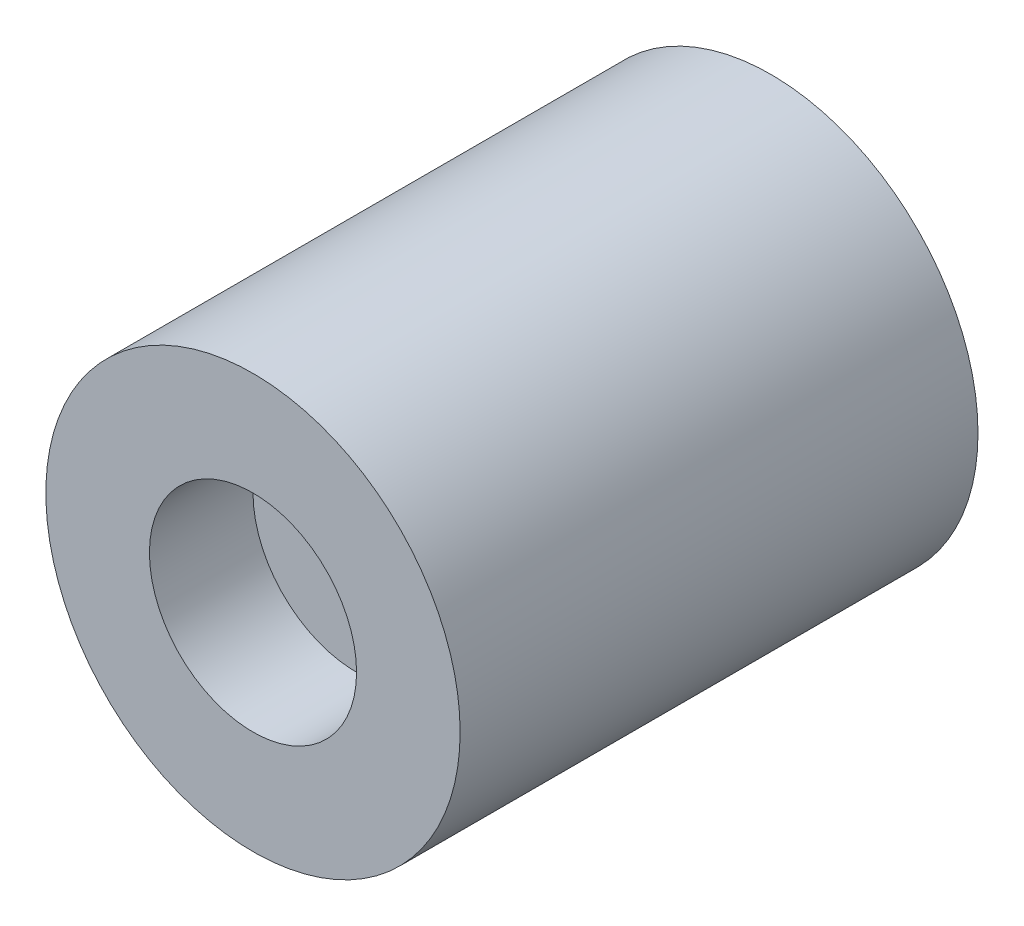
from build123d import *

# Parameters (mm, degrees)
SKETCH_1_R             = 10
EXTRUDE_1_DEPTH        = 25
SKETCH_2_R             = 5
CUT_EXTRUDE_1_DEPTH    = 5
HOLE_WIZARD_M6_1_D     = 5
HOLE_WIZARD_M6_1_DEPTH = 15
HOLE_WIZARD_M6_1_TIP   = 1.502151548


with BuildPart() as part:
    # Sketch 1 → Extrude 1 (new body)
    with BuildSketch(Plane.XY):
        Circle(SKETCH_1_R)
    extrude(amount=EXTRUDE_1_DEPTH)

    # Sketch 2 → Cut-Extrude 1 (cut)
    with BuildSketch(Plane.XY.offset(25)):
        Circle(SKETCH_2_R)
    extrude(amount=-CUT_EXTRUDE_1_DEPTH, mode=Mode.SUBTRACT)

    # Hole Wizard M6 _1
    with Locations(Plane(origin=(0, 0, 0), x_dir=(-1, 0, 0), z_dir=(0, 0, -1))):
        with Locations((0, 0)):
            Hole(HOLE_WIZARD_M6_1_D / 2, depth=HOLE_WIZARD_M6_1_DEPTH)
            with Locations((0, 0, -(HOLE_WIZARD_M6_1_DEPTH + HOLE_WIZARD_M6_1_TIP / 2))):  # 118° drill point
                Cone(0, HOLE_WIZARD_M6_1_D / 2, HOLE_WIZARD_M6_1_TIP, mode=Mode.SUBTRACT)


solid = part.part
